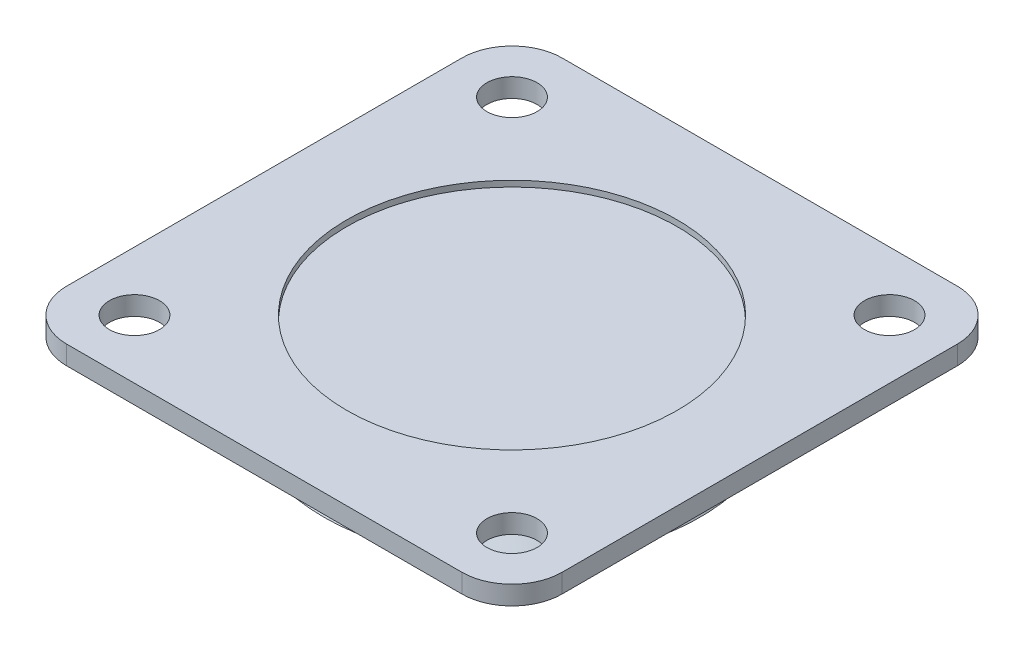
from build123d import *

# Parameters (mm, degrees)
SKETCH_1_R          = 4.25
EXTRUDE_1_DEPTH     = 3.2
SKETCH_2_R          = 28
CUT_EXTRUDE_1_DEPTH = 1


with BuildPart() as part:
    # Sketch 1 → Extrude 1 (new body)
    with BuildSketch(Plane(origin=(0, 0, 0), x_dir=(1, 0, 0), z_dir=(0, 1, 0))):
        with BuildLine():
            Line((-42, 33.5), (-42, -33.5))
            ThreePointArc((-42, -33.5), (-39.51040764, -39.51040764), (-33.5, -42))
            Line((-33.5, -42), (33.5, -42))
            ThreePointArc((33.5, -42), (39.51040764, -39.51040764), (42, -33.5))
            Line((42, -33.5), (42, 33.5))
            ThreePointArc((42, 33.5), (39.51040764, 39.51040764), (33.5, 42))
            Line((33.5, 42), (-33.5, 42))
            ThreePointArc((-33.5, 42), (-39.51040764, 39.51040764), (-42, 33.5))
        make_face()
        with Locations(Location((32, -32, 0), (0, 0, 270))):
            Circle(SKETCH_1_R, mode=Mode.SUBTRACT)
        with Locations(Location((32, 32, 0), (0, 0, 270))):
            Circle(SKETCH_1_R, mode=Mode.SUBTRACT)
        with Locations(Location((-32, -32, 0), (0, 0, 270))):
            Circle(SKETCH_1_R, mode=Mode.SUBTRACT)
        with Locations(Location((-32, 32, 0), (0, 0, 270))):
            Circle(SKETCH_1_R, mode=Mode.SUBTRACT)
    extrude(amount=-EXTRUDE_1_DEPTH)

    # Sketch 2 → Cut-Extrude 1 (cut)
    with BuildSketch(Plane(origin=(0, 0, 0), x_dir=(1, 0, 0), z_dir=(0, 1, 0))):
        with Locations(Location((0, 0, 0), (0, 0, 270))):
            Circle(SKETCH_2_R)
    extrude(amount=-CUT_EXTRUDE_1_DEPTH, mode=Mode.SUBTRACT)

    # Sketch 3 → Revolve 1 (revolve)
    with BuildSketch(Plane.XY, mode=Mode.PRIVATE) as revolve_1_sk:
        with BuildLine():
            Line((0, -3.2), (31.92, -3.2))
            Line((31.92, -3.2), (28.719512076, -7.200609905))
            ThreePointArc((28.719512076, -7.200609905), (28.281249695, -8.45), (28.719512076, -9.699390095))
            Line((28.719512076, -9.699390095), (31.92, -13.7))
            Line((31.92, -13.7), (0, -13.7))
            Line((0, -13.7), (0, -3.2))
        make_face()
    revolve(revolve_1_sk.sketch.rotate(Axis((0, -13.7, 0), (0, 1, 0)), 270), axis=Axis((0, -13.7, 0), (0, 1, 0)))


solid = part.part
